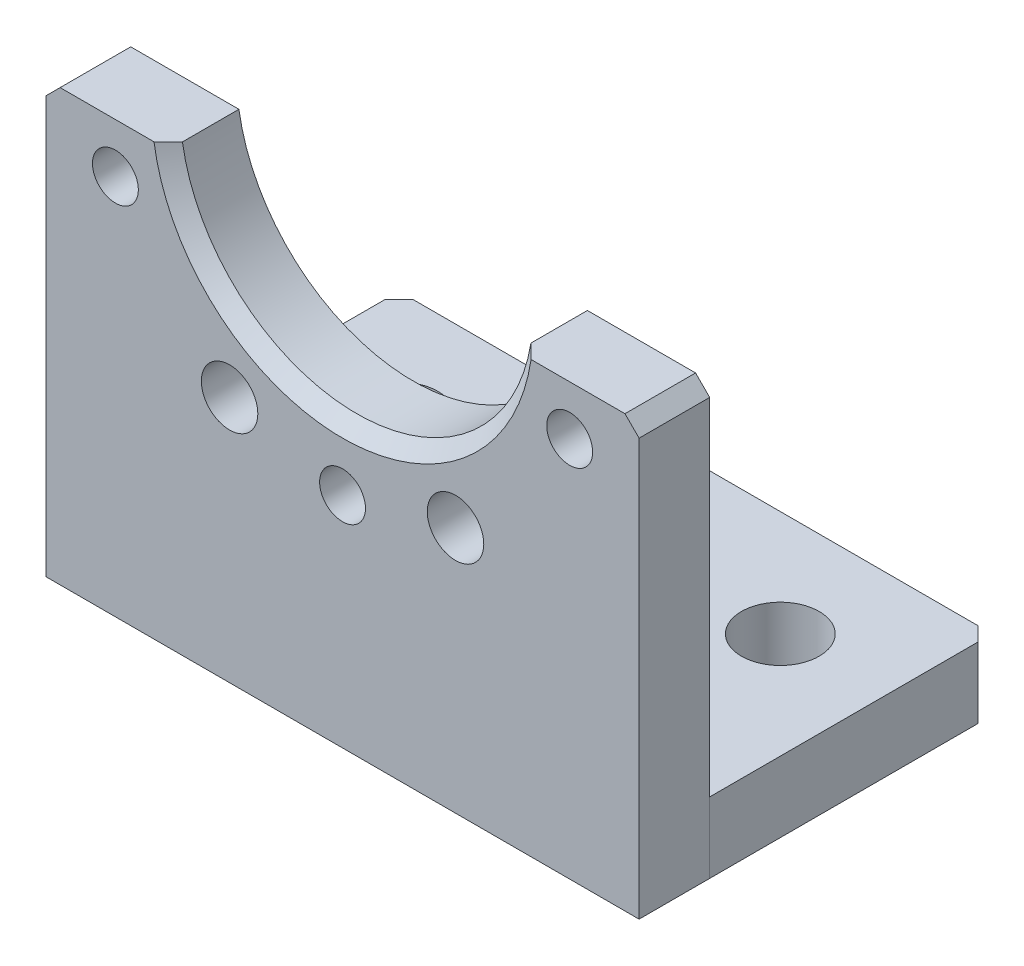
ISO-10303-21;
HEADER;
FILE_DESCRIPTION(('STEP AP214'),'2;1');
FILE_NAME('part.step','',(''),(''),'','','');
FILE_SCHEMA(('AUTOMOTIVE_DESIGN { 1 0 10303 214 1 1 1 1 }'));
ENDSEC;
DATA;
#1=APPLICATION_CONTEXT('core data for automotive mechanical design processes');
#2=APPLICATION_PROTOCOL_DEFINITION('international standard','automotive_design',2000,#1);
#3=PRODUCT_CONTEXT('',#1,'mechanical');
#4=PRODUCT('Part','Part','',(#3));
#5=PRODUCT_RELATED_PRODUCT_CATEGORY('part','',(#4));
#6=PRODUCT_DEFINITION_FORMATION('','',#4);
#7=PRODUCT_DEFINITION_CONTEXT('part definition',#1,'design');
#8=PRODUCT_DEFINITION('design','',#6,#7);
#9=PRODUCT_DEFINITION_SHAPE('','',#8);
#10=(LENGTH_UNIT() NAMED_UNIT(*) SI_UNIT(.MILLI.,.METRE.));
#11=(NAMED_UNIT(*) PLANE_ANGLE_UNIT() SI_UNIT($,.RADIAN.));
#12=(NAMED_UNIT(*) SI_UNIT($,.STERADIAN.) SOLID_ANGLE_UNIT());
#13=UNCERTAINTY_MEASURE_WITH_UNIT(LENGTH_MEASURE(1.E-05),#10,'distance_accuracy_value','');
#14=(GEOMETRIC_REPRESENTATION_CONTEXT(3) GLOBAL_UNCERTAINTY_ASSIGNED_CONTEXT((#13)) GLOBAL_UNIT_ASSIGNED_CONTEXT((#10,
#11,#12)) REPRESENTATION_CONTEXT('',''));
#15=CARTESIAN_POINT('',(0.,0.,0.));
#16=DIRECTION('',(0.,0.,1.));
#17=DIRECTION('',(1.,0.,0.));
#18=AXIS2_PLACEMENT_3D('',#15,#16,#17);
#19=CARTESIAN_POINT('',(-42.,59.,-10.));
#20=DIRECTION('',(0.,0.,-1.));
#21=DIRECTION('',(-1.,0.,0.));
#22=AXIS2_PLACEMENT_3D('',#19,#20,#21);
#23=PLANE('',#22);
#24=DIRECTION('',(1.,0.,0.));
#25=VECTOR('',#24,1.);
#26=CARTESIAN_POINT('',(-42.,0.,-10.));
#27=LINE('',#26,#25);
#28=CARTESIAN_POINT('',(-42.,0.,-10.));
#29=VERTEX_POINT('',#28);
#30=CARTESIAN_POINT('',(42.,0.,-10.));
#31=VERTEX_POINT('',#30);
#32=EDGE_CURVE('E138',#29,#31,#27,.T.);
#33=ORIENTED_EDGE('',*,*,#32,.F.);
#34=DIRECTION('',(0.,-1.,0.));
#35=VECTOR('',#34,1.);
#36=CARTESIAN_POINT('',(-42.,0.,-10.));
#37=LINE('',#36,#35);
#38=CARTESIAN_POINT('',(-42.,59.,-10.));
#39=VERTEX_POINT('',#38);
#40=EDGE_CURVE('E146',#39,#29,#37,.T.);
#41=ORIENTED_EDGE('',*,*,#40,.F.);
#42=DIRECTION('',(-0.707106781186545,-0.70710678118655,0.));
#43=VECTOR('',#42,1.);
#44=CARTESIAN_POINT('',(-50.5000000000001,50.4999999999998,-10.));
#45=LINE('',#44,#43);
#46=CARTESIAN_POINT('',(-40.,61.,-10.));
#47=VERTEX_POINT('',#46);
#48=EDGE_CURVE('E240',#39,#47,#45,.F.);
#49=ORIENTED_EDGE('',*,*,#48,.T.);
#50=DIRECTION('',(-1.,0.,0.));
#51=VECTOR('',#50,1.);
#52=CARTESIAN_POINT('',(-42.,61.,-10.));
#53=LINE('',#52,#51);
#54=CARTESIAN_POINT('',(-24.6779253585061,61.,-10.));
#55=VERTEX_POINT('',#54);
#56=EDGE_CURVE('E147',#55,#47,#53,.T.);
#57=ORIENTED_EDGE('',*,*,#56,.F.);
#58=CARTESIAN_POINT('',(0.,65.,-10.));
#59=DIRECTION('',(0.,0.,-1.));
#60=DIRECTION('',(-1.,0.,0.));
#61=AXIS2_PLACEMENT_3D('',#58,#59,#60);
#62=CIRCLE('',#61,25.);
#63=CARTESIAN_POINT('',(24.6779253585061,61.,-10.));
#64=VERTEX_POINT('',#63);
#65=EDGE_CURVE('E76',#64,#55,#62,.T.);
#66=ORIENTED_EDGE('',*,*,#65,.F.);
#67=CARTESIAN_POINT('',(40.,61.,-10.));
#68=VERTEX_POINT('',#67);
#69=EDGE_CURVE('E184',#68,#64,#53,.T.);
#70=ORIENTED_EDGE('',*,*,#69,.F.);
#71=DIRECTION('',(-0.707106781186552,0.707106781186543,0.));
#72=VECTOR('',#71,1.);
#73=CARTESIAN_POINT('',(50.4999999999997,50.5000000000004,-10.));
#74=LINE('',#73,#72);
#75=CARTESIAN_POINT('',(42.,59.,-10.));
#76=VERTEX_POINT('',#75);
#77=EDGE_CURVE('E141',#68,#76,#74,.F.);
#78=ORIENTED_EDGE('',*,*,#77,.T.);
#79=DIRECTION('',(0.,1.,0.));
#80=VECTOR('',#79,1.);
#81=CARTESIAN_POINT('',(42.,0.,-10.));
#82=LINE('',#81,#80);
#83=EDGE_CURVE('E134',#31,#76,#82,.T.);
#84=ORIENTED_EDGE('',*,*,#83,.F.);
#85=EDGE_LOOP('',(#33,#41,#49,#57,#66,#70,#78,#84));
#86=FACE_BOUND('',#85,.T.);
#87=CARTESIAN_POINT('',(16.,35.,-10.));
#88=DIRECTION('',(0.,0.,-1.));
#89=DIRECTION('',(-1.,0.,0.));
#90=AXIS2_PLACEMENT_3D('',#87,#88,#89);
#91=CIRCLE('',#90,4.);
#92=CARTESIAN_POINT('',(12.,35.,-10.));
#93=VERTEX_POINT('',#92);
#94=EDGE_CURVE('E68',#93,#93,#91,.T.);
#95=ORIENTED_EDGE('',*,*,#94,.F.);
#96=EDGE_LOOP('',(#95));
#97=FACE_BOUND('',#96,.T.);
#98=CARTESIAN_POINT('',(-16.,35.,-10.));
#99=DIRECTION('',(0.,0.,-1.));
#100=DIRECTION('',(-1.,0.,0.));
#101=AXIS2_PLACEMENT_3D('',#98,#99,#100);
#102=CIRCLE('',#101,4.);
#103=CARTESIAN_POINT('',(-20.,35.,-10.));
#104=VERTEX_POINT('',#103);
#105=EDGE_CURVE('E166',#104,#104,#102,.T.);
#106=ORIENTED_EDGE('',*,*,#105,.F.);
#107=EDGE_LOOP('',(#106));
#108=FACE_BOUND('',#107,.T.);
#109=CARTESIAN_POINT('',(-32.1714158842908,54.,-10.));
#110=DIRECTION('',(0.,0.,-1.));
#111=DIRECTION('',(-1.,0.,0.));
#112=AXIS2_PLACEMENT_3D('',#109,#110,#111);
#113=CIRCLE('',#112,3.25);
#114=CARTESIAN_POINT('',(-35.4214158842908,54.,-10.));
#115=VERTEX_POINT('',#114);
#116=EDGE_CURVE('E170',#115,#115,#113,.T.);
#117=ORIENTED_EDGE('',*,*,#116,.F.);
#118=EDGE_LOOP('',(#117));
#119=FACE_BOUND('',#118,.T.);
#120=CARTESIAN_POINT('',(32.1714158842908,54.,-10.));
#121=DIRECTION('',(0.,0.,-1.));
#122=DIRECTION('',(-1.,0.,0.));
#123=AXIS2_PLACEMENT_3D('',#120,#121,#122);
#124=CIRCLE('',#123,3.25);
#125=CARTESIAN_POINT('',(28.9214158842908,54.,-10.));
#126=VERTEX_POINT('',#125);
#127=EDGE_CURVE('E174',#126,#126,#124,.T.);
#128=ORIENTED_EDGE('',*,*,#127,.F.);
#129=EDGE_LOOP('',(#128));
#130=FACE_BOUND('',#129,.T.);
#131=CARTESIAN_POINT('',(0.,31.,-10.));
#132=DIRECTION('',(0.,0.,-1.));
#133=DIRECTION('',(-1.,0.,0.));
#134=AXIS2_PLACEMENT_3D('',#131,#132,#133);
#135=CIRCLE('',#134,3.25);
#136=CARTESIAN_POINT('',(-3.25,31.,-10.));
#137=VERTEX_POINT('',#136);
#138=EDGE_CURVE('E178',#137,#137,#135,.T.);
#139=ORIENTED_EDGE('',*,*,#138,.F.);
#140=EDGE_LOOP('',(#139));
#141=FACE_BOUND('',#140,.T.);
#142=ADVANCED_FACE('F59',(#86,#97,#108,#119,#130,#141),#23,.T.);
#143=CARTESIAN_POINT('',(-42.,0.,-50.));
#144=DIRECTION('',(0.,-1.,0.));
#145=DIRECTION('',(0.,0.,-1.));
#146=AXIS2_PLACEMENT_3D('',#143,#144,#145);
#147=PLANE('',#146);
#148=DIRECTION('',(0.,0.,1.));
#149=VECTOR('',#148,1.);
#150=CARTESIAN_POINT('',(-42.,0.,-50.));
#151=LINE('',#150,#149);
#152=CARTESIAN_POINT('',(-42.,0.,0.));
#153=VERTEX_POINT('',#152);
#154=EDGE_CURVE('E63',#29,#153,#151,.T.);
#155=ORIENTED_EDGE('',*,*,#154,.F.);
#156=ORIENTED_EDGE('',*,*,#32,.T.);
#157=DIRECTION('',(0.,0.,1.));
#158=VECTOR('',#157,1.);
#159=CARTESIAN_POINT('',(42.,0.,-50.));
#160=LINE('',#159,#158);
#161=CARTESIAN_POINT('',(42.,0.,0.));
#162=VERTEX_POINT('',#161);
#163=EDGE_CURVE('E151',#31,#162,#160,.T.);
#164=ORIENTED_EDGE('',*,*,#163,.T.);
#165=DIRECTION('',(1.,0.,0.));
#166=VECTOR('',#165,1.);
#167=CARTESIAN_POINT('',(-42.,0.,0.));
#168=LINE('',#167,#166);
#169=EDGE_CURVE('E188',#153,#162,#168,.T.);
#170=ORIENTED_EDGE('',*,*,#169,.F.);
#171=EDGE_LOOP('',(#155,#156,#164,#170));
#172=FACE_BOUND('',#171,.T.);
#173=ADVANCED_FACE('F61',(#172),#147,.T.);
#174=CARTESIAN_POINT('',(0.,65.,-2.));
#175=DIRECTION('',(0.,0.,1.));
#176=DIRECTION('',(1.,0.,0.));
#177=AXIS2_PLACEMENT_3D('',#174,#175,#176);
#178=CONICAL_SURFACE('',#177,25.,0.785398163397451);
#179=CARTESIAN_POINT('',(-26.7020598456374,61.,0.));
#180=CARTESIAN_POINT('',(-26.3648597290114,61.,-0.333490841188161));
#181=CARTESIAN_POINT('',(-26.0275817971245,61.,-0.666902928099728));
#182=CARTESIAN_POINT('',(-25.3528703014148,61.,-1.33356959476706));
#183=CARTESIAN_POINT('',(-25.0154367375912,61.,-1.66682417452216));
#184=CARTESIAN_POINT('',(-24.6779253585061,61.,-2.));
#185=B_SPLINE_CURVE_WITH_KNOTS('',3,(#179,#180,#181,#182,#183,#184),.UNSPECIFIED.,.F.,.F.,(4,2,
4),(0.,1.42277201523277,2.84554403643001),.UNSPECIFIED.);
#186=CARTESIAN_POINT('',(-26.7020598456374,61.,0.));
#187=VERTEX_POINT('',#186);
#188=CARTESIAN_POINT('',(-24.6779253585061,61.,-2.00000000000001));
#189=VERTEX_POINT('',#188);
#190=EDGE_CURVE('E223',#187,#189,#185,.T.);
#191=ORIENTED_EDGE('',*,*,#190,.F.);
#192=CARTESIAN_POINT('',(0.,65.,0.));
#193=DIRECTION('',(0.,0.,-1.));
#194=DIRECTION('',(-1.,0.,0.));
#195=AXIS2_PLACEMENT_3D('',#192,#193,#194);
#196=CIRCLE('',#195,27.);
#197=CARTESIAN_POINT('',(26.7020598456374,61.,0.));
#198=VERTEX_POINT('',#197);
#199=EDGE_CURVE('E209',#198,#187,#196,.T.);
#200=ORIENTED_EDGE('',*,*,#199,.F.);
#201=CARTESIAN_POINT('',(24.6779253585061,61.,-2.));
#202=CARTESIAN_POINT('',(25.0154367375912,61.,-1.66682417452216));
#203=CARTESIAN_POINT('',(25.3528703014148,61.,-1.33356959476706));
#204=CARTESIAN_POINT('',(26.0275817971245,61.,-0.666902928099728));
#205=CARTESIAN_POINT('',(26.3648597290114,61.,-0.333490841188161));
#206=CARTESIAN_POINT('',(26.7020598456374,61.,0.));
#207=B_SPLINE_CURVE_WITH_KNOTS('',3,(#201,#202,#203,#204,#205,#206),.UNSPECIFIED.,.F.,.F.,(4,2,
4),(0.,1.42277202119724,2.84554403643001),.UNSPECIFIED.);
#208=CARTESIAN_POINT('',(24.6779253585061,61.,-2.00000000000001));
#209=VERTEX_POINT('',#208);
#210=EDGE_CURVE('E201',#209,#198,#207,.T.);
#211=ORIENTED_EDGE('',*,*,#210,.F.);
#212=CARTESIAN_POINT('',(0.,65.,-2.));
#213=DIRECTION('',(0.,0.,-1.));
#214=DIRECTION('',(-1.,0.,0.));
#215=AXIS2_PLACEMENT_3D('',#212,#213,#214);
#216=CIRCLE('',#215,25.);
#217=EDGE_CURVE('E160',#189,#209,#216,.F.);
#218=ORIENTED_EDGE('',*,*,#217,.F.);
#219=EDGE_LOOP('',(#191,#200,#211,#218));
#220=FACE_BOUND('',#219,.T.);
#221=ADVANCED_FACE('F214',(#220),#178,.F.);
#222=CARTESIAN_POINT('',(-42.,61.,-50.));
#223=DIRECTION('',(0.,1.,0.));
#224=DIRECTION('',(0.,0.,1.));
#225=AXIS2_PLACEMENT_3D('',#222,#223,#224);
#226=PLANE('',#225);
#227=ORIENTED_EDGE('',*,*,#56,.T.);
#228=DIRECTION('',(0.,0.,1.));
#229=VECTOR('',#228,1.);
#230=CARTESIAN_POINT('',(-40.,61.,-50.));
#231=LINE('',#230,#229);
#232=CARTESIAN_POINT('',(-40.,61.,0.));
#233=VERTEX_POINT('',#232);
#234=EDGE_CURVE('E232',#47,#233,#231,.T.);
#235=ORIENTED_EDGE('',*,*,#234,.T.);
#236=DIRECTION('',(-1.,0.,0.));
#237=VECTOR('',#236,1.);
#238=CARTESIAN_POINT('',(-42.,61.,0.));
#239=LINE('',#238,#237);
#240=EDGE_CURVE('E191',#187,#233,#239,.T.);
#241=ORIENTED_EDGE('',*,*,#240,.F.);
#242=ORIENTED_EDGE('',*,*,#190,.T.);
#243=DIRECTION('',(0.,0.,1.));
#244=VECTOR('',#243,1.);
#245=CARTESIAN_POINT('',(-24.6779253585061,61.,-50.));
#246=LINE('',#245,#244);
#247=EDGE_CURVE('E181',#55,#189,#246,.T.);
#248=ORIENTED_EDGE('',*,*,#247,.F.);
#249=EDGE_LOOP('',(#227,#235,#241,#242,#248));
#250=FACE_BOUND('',#249,.T.);
#251=ADVANCED_FACE('F218',(#250),#226,.T.);
#252=CARTESIAN_POINT('',(42.,0.,-50.));
#253=DIRECTION('',(1.,0.,0.));
#254=DIRECTION('',(0.,1.,0.));
#255=AXIS2_PLACEMENT_3D('',#252,#253,#254);
#256=PLANE('',#255);
#257=ORIENTED_EDGE('',*,*,#163,.F.);
#258=ORIENTED_EDGE('',*,*,#83,.T.);
#259=DIRECTION('',(0.,0.,1.));
#260=VECTOR('',#259,1.);
#261=CARTESIAN_POINT('',(42.,59.,-50.));
#262=LINE('',#261,#260);
#263=CARTESIAN_POINT('',(42.,59.,0.));
#264=VERTEX_POINT('',#263);
#265=EDGE_CURVE('E230',#76,#264,#262,.T.);
#266=ORIENTED_EDGE('',*,*,#265,.T.);
#267=DIRECTION('',(0.,1.,0.));
#268=VECTOR('',#267,1.);
#269=CARTESIAN_POINT('',(42.,0.,0.));
#270=LINE('',#269,#268);
#271=EDGE_CURVE('E157',#162,#264,#270,.T.);
#272=ORIENTED_EDGE('',*,*,#271,.F.);
#273=EDGE_LOOP('',(#257,#258,#266,#272));
#274=FACE_BOUND('',#273,.T.);
#275=ADVANCED_FACE('F155',(#274),#256,.T.);
#276=CARTESIAN_POINT('',(0.,0.,0.));
#277=DIRECTION('',(0.,0.,-1.));
#278=DIRECTION('',(-1.,0.,0.));
#279=AXIS2_PLACEMENT_3D('',#276,#277,#278);
#280=PLANE('',#279);
#281=CARTESIAN_POINT('',(16.,35.,0.));
#282=DIRECTION('',(0.,0.,1.));
#283=DIRECTION('',(1.,0.,0.));
#284=AXIS2_PLACEMENT_3D('',#281,#282,#283);
#285=CIRCLE('',#284,4.);
#286=CARTESIAN_POINT('',(20.,35.,0.));
#287=VERTEX_POINT('',#286);
#288=EDGE_CURVE('E15',#287,#287,#285,.T.);
#289=ORIENTED_EDGE('',*,*,#288,.F.);
#290=EDGE_LOOP('',(#289));
#291=FACE_BOUND('',#290,.T.);
#292=CARTESIAN_POINT('',(-16.,35.,0.));
#293=DIRECTION('',(0.,0.,1.));
#294=DIRECTION('',(1.,0.,0.));
#295=AXIS2_PLACEMENT_3D('',#292,#293,#294);
#296=CIRCLE('',#295,4.);
#297=CARTESIAN_POINT('',(-12.,35.,0.));
#298=VERTEX_POINT('',#297);
#299=EDGE_CURVE('E163',#298,#298,#296,.T.);
#300=ORIENTED_EDGE('',*,*,#299,.F.);
#301=EDGE_LOOP('',(#300));
#302=FACE_BOUND('',#301,.T.);
#303=CARTESIAN_POINT('',(-32.1714158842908,54.,0.));
#304=DIRECTION('',(0.,0.,1.));
#305=DIRECTION('',(1.,0.,0.));
#306=AXIS2_PLACEMENT_3D('',#303,#304,#305);
#307=CIRCLE('',#306,3.25);
#308=CARTESIAN_POINT('',(-28.9214158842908,54.,0.));
#309=VERTEX_POINT('',#308);
#310=EDGE_CURVE('E167',#309,#309,#307,.T.);
#311=ORIENTED_EDGE('',*,*,#310,.F.);
#312=EDGE_LOOP('',(#311));
#313=FACE_BOUND('',#312,.T.);
#314=CARTESIAN_POINT('',(32.1714158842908,54.,0.));
#315=DIRECTION('',(0.,0.,1.));
#316=DIRECTION('',(1.,0.,0.));
#317=AXIS2_PLACEMENT_3D('',#314,#315,#316);
#318=CIRCLE('',#317,3.25);
#319=CARTESIAN_POINT('',(35.4214158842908,54.,0.));
#320=VERTEX_POINT('',#319);
#321=EDGE_CURVE('E171',#320,#320,#318,.T.);
#322=ORIENTED_EDGE('',*,*,#321,.F.);
#323=EDGE_LOOP('',(#322));
#324=FACE_BOUND('',#323,.T.);
#325=CARTESIAN_POINT('',(0.,31.,0.));
#326=DIRECTION('',(0.,0.,1.));
#327=DIRECTION('',(1.,0.,0.));
#328=AXIS2_PLACEMENT_3D('',#325,#326,#327);
#329=CIRCLE('',#328,3.25);
#330=CARTESIAN_POINT('',(3.25,31.,0.));
#331=VERTEX_POINT('',#330);
#332=EDGE_CURVE('E175',#331,#331,#329,.T.);
#333=ORIENTED_EDGE('',*,*,#332,.F.);
#334=EDGE_LOOP('',(#333));
#335=FACE_BOUND('',#334,.T.);
#336=ORIENTED_EDGE('',*,*,#240,.T.);
#337=DIRECTION('',(0.707106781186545,0.70710678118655,0.));
#338=VECTOR('',#337,1.);
#339=CARTESIAN_POINT('',(-40.,61.,0.));
#340=LINE('',#339,#338);
#341=CARTESIAN_POINT('',(-42.,59.,0.));
#342=VERTEX_POINT('',#341);
#343=EDGE_CURVE('E237',#233,#342,#340,.F.);
#344=ORIENTED_EDGE('',*,*,#343,.T.);
#345=DIRECTION('',(0.,-1.,0.));
#346=VECTOR('',#345,1.);
#347=CARTESIAN_POINT('',(-42.,0.,0.));
#348=LINE('',#347,#346);
#349=EDGE_CURVE('E185',#342,#153,#348,.T.);
#350=ORIENTED_EDGE('',*,*,#349,.T.);
#351=ORIENTED_EDGE('',*,*,#169,.T.);
#352=ORIENTED_EDGE('',*,*,#271,.T.);
#353=DIRECTION('',(0.707106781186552,-0.707106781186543,0.));
#354=VECTOR('',#353,1.);
#355=CARTESIAN_POINT('',(42.,59.,0.));
#356=LINE('',#355,#354);
#357=CARTESIAN_POINT('',(40.,61.,0.));
#358=VERTEX_POINT('',#357);
#359=EDGE_CURVE('E235',#264,#358,#356,.F.);
#360=ORIENTED_EDGE('',*,*,#359,.T.);
#361=EDGE_CURVE('E159',#358,#198,#239,.T.);
#362=ORIENTED_EDGE('',*,*,#361,.T.);
#363=ORIENTED_EDGE('',*,*,#199,.T.);
#364=EDGE_LOOP('',(#336,#344,#350,#351,#352,#360,#362,#363));
#365=FACE_BOUND('',#364,.T.);
#366=ADVANCED_FACE('F269',(#291,#302,#313,#324,#335,#365),#280,.F.);
#367=CARTESIAN_POINT('',(16.,35.,-50.));
#368=DIRECTION('',(0.,0.,1.));
#369=DIRECTION('',(1.,0.,0.));
#370=AXIS2_PLACEMENT_3D('',#367,#368,#369);
#371=CYLINDRICAL_SURFACE('',#370,4.);
#372=ORIENTED_EDGE('',*,*,#94,.T.);
#373=EDGE_LOOP('',(#372));
#374=FACE_BOUND('',#373,.T.);
#375=ORIENTED_EDGE('',*,*,#288,.T.);
#376=EDGE_LOOP('',(#375));
#377=FACE_BOUND('',#376,.T.);
#378=ADVANCED_FACE('F248',(#374,#377),#371,.F.);
#379=CARTESIAN_POINT('',(-16.,35.,-50.));
#380=DIRECTION('',(0.,0.,1.));
#381=DIRECTION('',(1.,0.,0.));
#382=AXIS2_PLACEMENT_3D('',#379,#380,#381);
#383=CYLINDRICAL_SURFACE('',#382,4.);
#384=ORIENTED_EDGE('',*,*,#105,.T.);
#385=EDGE_LOOP('',(#384));
#386=FACE_BOUND('',#385,.T.);
#387=ORIENTED_EDGE('',*,*,#299,.T.);
#388=EDGE_LOOP('',(#387));
#389=FACE_BOUND('',#388,.T.);
#390=ADVANCED_FACE('F330',(#386,#389),#383,.F.);
#391=ORIENTED_EDGE('',*,*,#361,.F.);
#392=DIRECTION('',(0.,0.,-1.));
#393=VECTOR('',#392,1.);
#394=CARTESIAN_POINT('',(40.,61.,-50.));
#395=LINE('',#394,#393);
#396=EDGE_CURVE('E153',#358,#68,#395,.T.);
#397=ORIENTED_EDGE('',*,*,#396,.T.);
#398=ORIENTED_EDGE('',*,*,#69,.T.);
#399=DIRECTION('',(0.,0.,1.));
#400=VECTOR('',#399,1.);
#401=CARTESIAN_POINT('',(24.6779253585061,61.,-50.));
#402=LINE('',#401,#400);
#403=EDGE_CURVE('E179',#209,#64,#402,.F.);
#404=ORIENTED_EDGE('',*,*,#403,.F.);
#405=ORIENTED_EDGE('',*,*,#210,.T.);
#406=EDGE_LOOP('',(#391,#397,#398,#404,#405));
#407=FACE_BOUND('',#406,.T.);
#408=ADVANCED_FACE('F211',(#407),#226,.T.);
#409=CARTESIAN_POINT('',(42.,59.,-50.));
#410=DIRECTION('',(-0.707106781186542,-0.707106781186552,0.));
#411=DIRECTION('',(0.,0.,1.));
#412=AXIS2_PLACEMENT_3D('',#409,#410,#411);
#413=PLANE('',#412);
#414=ORIENTED_EDGE('',*,*,#77,.F.);
#415=ORIENTED_EDGE('',*,*,#396,.F.);
#416=ORIENTED_EDGE('',*,*,#359,.F.);
#417=ORIENTED_EDGE('',*,*,#265,.F.);
#418=EDGE_LOOP('',(#414,#415,#416,#417));
#419=FACE_BOUND('',#418,.T.);
#420=ADVANCED_FACE('F287',(#419),#413,.F.);
#421=CARTESIAN_POINT('',(-42.,0.,-50.));
#422=DIRECTION('',(-1.,0.,0.));
#423=DIRECTION('',(0.,0.,1.));
#424=AXIS2_PLACEMENT_3D('',#421,#422,#423);
#425=PLANE('',#424);
#426=ORIENTED_EDGE('',*,*,#40,.T.);
#427=ORIENTED_EDGE('',*,*,#154,.T.);
#428=ORIENTED_EDGE('',*,*,#349,.F.);
#429=DIRECTION('',(0.,0.,-1.));
#430=VECTOR('',#429,1.);
#431=CARTESIAN_POINT('',(-42.,59.,-50.));
#432=LINE('',#431,#430);
#433=EDGE_CURVE('E228',#342,#39,#432,.T.);
#434=ORIENTED_EDGE('',*,*,#433,.T.);
#435=EDGE_LOOP('',(#426,#427,#428,#434));
#436=FACE_BOUND('',#435,.T.);
#437=ADVANCED_FACE('F289',(#436),#425,.T.);
#438=CARTESIAN_POINT('',(-40.,61.,-50.));
#439=DIRECTION('',(0.70710678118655,-0.707106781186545,0.));
#440=DIRECTION('',(0.,0.,1.));
#441=AXIS2_PLACEMENT_3D('',#438,#439,#440);
#442=PLANE('',#441);
#443=ORIENTED_EDGE('',*,*,#48,.F.);
#444=ORIENTED_EDGE('',*,*,#433,.F.);
#445=ORIENTED_EDGE('',*,*,#343,.F.);
#446=ORIENTED_EDGE('',*,*,#234,.F.);
#447=EDGE_LOOP('',(#443,#444,#445,#446));
#448=FACE_BOUND('',#447,.T.);
#449=ADVANCED_FACE('F220',(#448),#442,.F.);
#450=CARTESIAN_POINT('',(-32.1714158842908,54.,-50.));
#451=DIRECTION('',(0.,0.,1.));
#452=DIRECTION('',(1.,0.,0.));
#453=AXIS2_PLACEMENT_3D('',#450,#451,#452);
#454=CYLINDRICAL_SURFACE('',#453,3.25);
#455=ORIENTED_EDGE('',*,*,#116,.T.);
#456=EDGE_LOOP('',(#455));
#457=FACE_BOUND('',#456,.T.);
#458=ORIENTED_EDGE('',*,*,#310,.T.);
#459=EDGE_LOOP('',(#458));
#460=FACE_BOUND('',#459,.T.);
#461=ADVANCED_FACE('F293',(#457,#460),#454,.F.);
#462=CARTESIAN_POINT('',(32.1714158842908,54.,-50.));
#463=DIRECTION('',(0.,0.,1.));
#464=DIRECTION('',(1.,0.,0.));
#465=AXIS2_PLACEMENT_3D('',#462,#463,#464);
#466=CYLINDRICAL_SURFACE('',#465,3.25);
#467=ORIENTED_EDGE('',*,*,#127,.T.);
#468=EDGE_LOOP('',(#467));
#469=FACE_BOUND('',#468,.T.);
#470=ORIENTED_EDGE('',*,*,#321,.T.);
#471=EDGE_LOOP('',(#470));
#472=FACE_BOUND('',#471,.T.);
#473=ADVANCED_FACE('F265',(#469,#472),#466,.F.);
#474=CARTESIAN_POINT('',(0.,31.,-50.));
#475=DIRECTION('',(0.,0.,1.));
#476=DIRECTION('',(1.,0.,0.));
#477=AXIS2_PLACEMENT_3D('',#474,#475,#476);
#478=CYLINDRICAL_SURFACE('',#477,3.25);
#479=ORIENTED_EDGE('',*,*,#138,.T.);
#480=EDGE_LOOP('',(#479));
#481=FACE_BOUND('',#480,.T.);
#482=ORIENTED_EDGE('',*,*,#332,.T.);
#483=EDGE_LOOP('',(#482));
#484=FACE_BOUND('',#483,.T.);
#485=ADVANCED_FACE('F262',(#481,#484),#478,.F.);
#486=CARTESIAN_POINT('',(0.,65.,-50.));
#487=DIRECTION('',(0.,0.,1.));
#488=DIRECTION('',(1.,0.,0.));
#489=AXIS2_PLACEMENT_3D('',#486,#487,#488);
#490=CYLINDRICAL_SURFACE('',#489,25.);
#491=ORIENTED_EDGE('',*,*,#247,.T.);
#492=ORIENTED_EDGE('',*,*,#217,.T.);
#493=ORIENTED_EDGE('',*,*,#403,.T.);
#494=ORIENTED_EDGE('',*,*,#65,.T.);
#495=EDGE_LOOP('',(#491,#492,#493,#494));
#496=FACE_BOUND('',#495,.T.);
#497=ADVANCED_FACE('F253',(#496),#490,.F.);
#498=CLOSED_SHELL('',(#142,#173,#221,#251,#275,#366,#378,#390,#408,#420,#437,#449,#461,#473,
#485,#497));
#499=MANIFOLD_SOLID_BREP('B2',#498);
#500=CARTESIAN_POINT('',(-42.,59.,-10.));
#501=DIRECTION('',(0.,0.,-1.));
#502=DIRECTION('',(-1.,0.,0.));
#503=AXIS2_PLACEMENT_3D('',#500,#501,#502);
#504=PLANE('',#503);
#505=DIRECTION('',(1.,0.,0.));
#506=VECTOR('',#505,1.);
#507=CARTESIAN_POINT('',(-42.,0.,-10.));
#508=LINE('',#507,#506);
#509=CARTESIAN_POINT('',(-42.,0.,-10.));
#510=VERTEX_POINT('',#509);
#511=CARTESIAN_POINT('',(42.,0.,-10.));
#512=VERTEX_POINT('',#511);
#513=EDGE_CURVE('E57',#510,#512,#508,.T.);
#514=ORIENTED_EDGE('',*,*,#513,.T.);
#515=DIRECTION('',(0.,1.,0.));
#516=VECTOR('',#515,1.);
#517=CARTESIAN_POINT('',(42.,0.,-10.));
#518=LINE('',#517,#516);
#519=CARTESIAN_POINT('',(42.,10.,-10.));
#520=VERTEX_POINT('',#519);
#521=EDGE_CURVE('E440',#512,#520,#518,.T.);
#522=ORIENTED_EDGE('',*,*,#521,.T.);
#523=DIRECTION('',(1.,0.,0.));
#524=VECTOR('',#523,1.);
#525=CARTESIAN_POINT('',(-42.,10.,-10.));
#526=LINE('',#525,#524);
#527=CARTESIAN_POINT('',(-42.,10.,-10.));
#528=VERTEX_POINT('',#527);
#529=EDGE_CURVE('E493',#528,#520,#526,.T.);
#530=ORIENTED_EDGE('',*,*,#529,.F.);
#531=DIRECTION('',(0.,-1.,0.));
#532=VECTOR('',#531,1.);
#533=CARTESIAN_POINT('',(-42.,0.,-10.));
#534=LINE('',#533,#532);
#535=EDGE_CURVE('E446',#528,#510,#534,.T.);
#536=ORIENTED_EDGE('',*,*,#535,.T.);
#537=EDGE_LOOP('',(#514,#522,#530,#536));
#538=FACE_BOUND('',#537,.T.);
#539=ADVANCED_FACE('F433',(#538),#504,.F.);
#540=CARTESIAN_POINT('',(-42.,0.,-50.));
#541=DIRECTION('',(-1.,0.,0.));
#542=DIRECTION('',(0.,0.,1.));
#543=AXIS2_PLACEMENT_3D('',#540,#541,#542);
#544=PLANE('',#543);
#545=ORIENTED_EDGE('',*,*,#535,.F.);
#546=DIRECTION('',(0.,0.,1.));
#547=VECTOR('',#546,1.);
#548=CARTESIAN_POINT('',(-42.,10.,-50.));
#549=LINE('',#548,#547);
#550=CARTESIAN_POINT('',(-42.,10.,-48.));
#551=VERTEX_POINT('',#550);
#552=EDGE_CURVE('E488',#551,#528,#549,.T.);
#553=ORIENTED_EDGE('',*,*,#552,.F.);
#554=DIRECTION('',(0.,-1.,0.));
#555=VECTOR('',#554,1.);
#556=CARTESIAN_POINT('',(-42.,0.,-48.));
#557=LINE('',#556,#555);
#558=CARTESIAN_POINT('',(-42.,0.,-48.));
#559=VERTEX_POINT('',#558);
#560=EDGE_CURVE('E516',#551,#559,#557,.T.);
#561=ORIENTED_EDGE('',*,*,#560,.T.);
#562=DIRECTION('',(0.,0.,1.));
#563=VECTOR('',#562,1.);
#564=CARTESIAN_POINT('',(-42.,0.,-50.));
#565=LINE('',#564,#563);
#566=EDGE_CURVE('E491',#559,#510,#565,.T.);
#567=ORIENTED_EDGE('',*,*,#566,.T.);
#568=EDGE_LOOP('',(#545,#553,#561,#567));
#569=FACE_BOUND('',#568,.T.);
#570=ADVANCED_FACE('F485',(#569),#544,.T.);
#571=CARTESIAN_POINT('',(42.,0.,-50.));
#572=DIRECTION('',(1.,0.,0.));
#573=DIRECTION('',(0.,1.,0.));
#574=AXIS2_PLACEMENT_3D('',#571,#572,#573);
#575=PLANE('',#574);
#576=ORIENTED_EDGE('',*,*,#521,.F.);
#577=DIRECTION('',(0.,0.,1.));
#578=VECTOR('',#577,1.);
#579=CARTESIAN_POINT('',(42.,0.,-50.));
#580=LINE('',#579,#578);
#581=CARTESIAN_POINT('',(42.,0.,-48.));
#582=VERTEX_POINT('',#581);
#583=EDGE_CURVE('E513',#582,#512,#580,.T.);
#584=ORIENTED_EDGE('',*,*,#583,.F.);
#585=DIRECTION('',(0.,1.,0.));
#586=VECTOR('',#585,1.);
#587=CARTESIAN_POINT('',(42.,0.,-48.));
#588=LINE('',#587,#586);
#589=CARTESIAN_POINT('',(42.,10.,-48.));
#590=VERTEX_POINT('',#589);
#591=EDGE_CURVE('E492',#582,#590,#588,.T.);
#592=ORIENTED_EDGE('',*,*,#591,.T.);
#593=DIRECTION('',(0.,0.,1.));
#594=VECTOR('',#593,1.);
#595=CARTESIAN_POINT('',(42.,10.,-50.));
#596=LINE('',#595,#594);
#597=EDGE_CURVE('E503',#590,#520,#596,.T.);
#598=ORIENTED_EDGE('',*,*,#597,.T.);
#599=EDGE_LOOP('',(#576,#584,#592,#598));
#600=FACE_BOUND('',#599,.T.);
#601=ADVANCED_FACE('F533',(#600),#575,.T.);
#602=CARTESIAN_POINT('',(0.,0.,-50.));
#603=DIRECTION('',(0.,0.,-1.));
#604=DIRECTION('',(-1.,0.,0.));
#605=AXIS2_PLACEMENT_3D('',#602,#603,#604);
#606=PLANE('',#605);
#607=DIRECTION('',(1.,0.,0.));
#608=VECTOR('',#607,1.);
#609=CARTESIAN_POINT('',(-42.,0.,-50.));
#610=LINE('',#609,#608);
#611=CARTESIAN_POINT('',(-40.,0.,-50.));
#612=VERTEX_POINT('',#611);
#613=CARTESIAN_POINT('',(40.,0.,-50.));
#614=VERTEX_POINT('',#613);
#615=EDGE_CURVE('E505',#612,#614,#610,.T.);
#616=ORIENTED_EDGE('',*,*,#615,.F.);
#617=DIRECTION('',(0.,1.,0.));
#618=VECTOR('',#617,1.);
#619=CARTESIAN_POINT('',(-40.,0.,-50.));
#620=LINE('',#619,#618);
#621=CARTESIAN_POINT('',(-40.,10.,-50.));
#622=VERTEX_POINT('',#621);
#623=EDGE_CURVE('E525',#612,#622,#620,.T.);
#624=ORIENTED_EDGE('',*,*,#623,.T.);
#625=DIRECTION('',(1.,0.,0.));
#626=VECTOR('',#625,1.);
#627=CARTESIAN_POINT('',(-42.,10.,-50.));
#628=LINE('',#627,#626);
#629=CARTESIAN_POINT('',(40.,10.,-50.));
#630=VERTEX_POINT('',#629);
#631=EDGE_CURVE('E496',#622,#630,#628,.T.);
#632=ORIENTED_EDGE('',*,*,#631,.T.);
#633=DIRECTION('',(0.,-1.,0.));
#634=VECTOR('',#633,1.);
#635=CARTESIAN_POINT('',(40.,0.,-50.));
#636=LINE('',#635,#634);
#637=EDGE_CURVE('E523',#630,#614,#636,.T.);
#638=ORIENTED_EDGE('',*,*,#637,.T.);
#639=EDGE_LOOP('',(#616,#624,#632,#638));
#640=FACE_BOUND('',#639,.T.);
#641=ADVANCED_FACE('F539',(#640),#606,.T.);
#642=CARTESIAN_POINT('',(-42.,0.,-50.));
#643=DIRECTION('',(0.,-1.,0.));
#644=DIRECTION('',(0.,0.,-1.));
#645=AXIS2_PLACEMENT_3D('',#642,#643,#644);
#646=PLANE('',#645);
#647=ORIENTED_EDGE('',*,*,#513,.F.);
#648=ORIENTED_EDGE('',*,*,#566,.F.);
#649=DIRECTION('',(-0.70710678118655,0.,0.707106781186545));
#650=VECTOR('',#649,1.);
#651=CARTESIAN_POINT('',(-41.,0.,-49.));
#652=LINE('',#651,#650);
#653=EDGE_CURVE('E521',#559,#612,#652,.F.);
#654=ORIENTED_EDGE('',*,*,#653,.T.);
#655=ORIENTED_EDGE('',*,*,#615,.T.);
#656=DIRECTION('',(-0.70710678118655,0.,-0.707106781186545));
#657=VECTOR('',#656,1.);
#658=CARTESIAN_POINT('',(-1.00000000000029,0.,-91.));
#659=LINE('',#658,#657);
#660=EDGE_CURVE('E519',#614,#582,#659,.F.);
#661=ORIENTED_EDGE('',*,*,#660,.T.);
#662=ORIENTED_EDGE('',*,*,#583,.T.);
#663=EDGE_LOOP('',(#647,#648,#654,#655,#661,#662));
#664=FACE_BOUND('',#663,.T.);
#665=CARTESIAN_POINT('',(27.,0.,-35.));
#666=DIRECTION('',(0.,1.,0.));
#667=DIRECTION('',(0.,0.,1.));
#668=AXIS2_PLACEMENT_3D('',#665,#666,#667);
#669=CIRCLE('',#668,5.5);
#670=CARTESIAN_POINT('',(27.,0.,-29.5));
#671=VERTEX_POINT('',#670);
#672=EDGE_CURVE('E633',#671,#671,#669,.T.);
#673=ORIENTED_EDGE('',*,*,#672,.T.);
#674=EDGE_LOOP('',(#673));
#675=FACE_BOUND('',#674,.T.);
#676=CARTESIAN_POINT('',(-27.,0.,-35.));
#677=DIRECTION('',(0.,1.,0.));
#678=DIRECTION('',(0.,0.,1.));
#679=AXIS2_PLACEMENT_3D('',#676,#677,#678);
#680=CIRCLE('',#679,5.5);
#681=CARTESIAN_POINT('',(-27.,0.,-29.5));
#682=VERTEX_POINT('',#681);
#683=EDGE_CURVE('E497',#682,#682,#680,.T.);
#684=ORIENTED_EDGE('',*,*,#683,.T.);
#685=EDGE_LOOP('',(#684));
#686=FACE_BOUND('',#685,.T.);
#687=ADVANCED_FACE('F543',(#664,#675,#686),#646,.T.);
#688=CARTESIAN_POINT('',(-42.,10.,-50.));
#689=DIRECTION('',(0.,-1.,0.));
#690=DIRECTION('',(0.,0.,-1.));
#691=AXIS2_PLACEMENT_3D('',#688,#689,#690);
#692=PLANE('',#691);
#693=CARTESIAN_POINT('',(27.,10.,-35.));
#694=DIRECTION('',(0.,1.,0.));
#695=DIRECTION('',(0.,0.,1.));
#696=AXIS2_PLACEMENT_3D('',#693,#694,#695);
#697=CIRCLE('',#696,5.5);
#698=CARTESIAN_POINT('',(27.,10.,-29.5));
#699=VERTEX_POINT('',#698);
#700=EDGE_CURVE('E636',#699,#699,#697,.T.);
#701=ORIENTED_EDGE('',*,*,#700,.F.);
#702=EDGE_LOOP('',(#701));
#703=FACE_BOUND('',#702,.T.);
#704=CARTESIAN_POINT('',(-27.,10.,-35.));
#705=DIRECTION('',(0.,1.,0.));
#706=DIRECTION('',(0.,0.,1.));
#707=AXIS2_PLACEMENT_3D('',#704,#705,#706);
#708=CIRCLE('',#707,5.5);
#709=CARTESIAN_POINT('',(-27.,10.,-29.5));
#710=VERTEX_POINT('',#709);
#711=EDGE_CURVE('E638',#710,#710,#708,.T.);
#712=ORIENTED_EDGE('',*,*,#711,.F.);
#713=EDGE_LOOP('',(#712));
#714=FACE_BOUND('',#713,.T.);
#715=ORIENTED_EDGE('',*,*,#631,.F.);
#716=DIRECTION('',(0.70710678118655,0.,-0.707106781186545));
#717=VECTOR('',#716,1.);
#718=CARTESIAN_POINT('',(-42.,10.,-48.));
#719=LINE('',#718,#717);
#720=EDGE_CURVE('E502',#622,#551,#719,.F.);
#721=ORIENTED_EDGE('',*,*,#720,.T.);
#722=ORIENTED_EDGE('',*,*,#552,.T.);
#723=ORIENTED_EDGE('',*,*,#529,.T.);
#724=ORIENTED_EDGE('',*,*,#597,.F.);
#725=DIRECTION('',(0.70710678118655,0.,0.707106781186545));
#726=VECTOR('',#725,1.);
#727=CARTESIAN_POINT('',(42.,10.,-48.));
#728=LINE('',#727,#726);
#729=EDGE_CURVE('E527',#590,#630,#728,.F.);
#730=ORIENTED_EDGE('',*,*,#729,.T.);
#731=EDGE_LOOP('',(#715,#721,#722,#723,#724,#730));
#732=FACE_BOUND('',#731,.T.);
#733=ADVANCED_FACE('F500',(#703,#714,#732),#692,.F.);
#734=CARTESIAN_POINT('',(-42.,0.,-48.));
#735=DIRECTION('',(0.707106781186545,0.,0.70710678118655));
#736=DIRECTION('',(0.,-1.,0.));
#737=AXIS2_PLACEMENT_3D('',#734,#735,#736);
#738=PLANE('',#737);
#739=ORIENTED_EDGE('',*,*,#720,.F.);
#740=ORIENTED_EDGE('',*,*,#623,.F.);
#741=ORIENTED_EDGE('',*,*,#653,.F.);
#742=ORIENTED_EDGE('',*,*,#560,.F.);
#743=EDGE_LOOP('',(#739,#740,#741,#742));
#744=FACE_BOUND('',#743,.T.);
#745=ADVANCED_FACE('F546',(#744),#738,.F.);
#746=CARTESIAN_POINT('',(42.,0.,-48.));
#747=DIRECTION('',(-0.707106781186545,0.,0.70710678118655));
#748=DIRECTION('',(0.,1.,0.));
#749=AXIS2_PLACEMENT_3D('',#746,#747,#748);
#750=PLANE('',#749);
#751=ORIENTED_EDGE('',*,*,#660,.F.);
#752=ORIENTED_EDGE('',*,*,#637,.F.);
#753=ORIENTED_EDGE('',*,*,#729,.F.);
#754=ORIENTED_EDGE('',*,*,#591,.F.);
#755=EDGE_LOOP('',(#751,#752,#753,#754));
#756=FACE_BOUND('',#755,.T.);
#757=ADVANCED_FACE('F541',(#756),#750,.F.);
#758=CARTESIAN_POINT('',(-27.,0.,-35.));
#759=DIRECTION('',(0.,1.,0.));
#760=DIRECTION('',(0.,0.,1.));
#761=AXIS2_PLACEMENT_3D('',#758,#759,#760);
#762=CYLINDRICAL_SURFACE('',#761,5.5);
#763=ORIENTED_EDGE('',*,*,#683,.F.);
#764=EDGE_LOOP('',(#763));
#765=FACE_BOUND('',#764,.T.);
#766=ORIENTED_EDGE('',*,*,#711,.T.);
#767=EDGE_LOOP('',(#766));
#768=FACE_BOUND('',#767,.T.);
#769=ADVANCED_FACE('F553',(#765,#768),#762,.F.);
#770=CARTESIAN_POINT('',(27.,0.,-35.));
#771=DIRECTION('',(0.,1.,0.));
#772=DIRECTION('',(0.,0.,1.));
#773=AXIS2_PLACEMENT_3D('',#770,#771,#772);
#774=CYLINDRICAL_SURFACE('',#773,5.5);
#775=ORIENTED_EDGE('',*,*,#672,.F.);
#776=EDGE_LOOP('',(#775));
#777=FACE_BOUND('',#776,.T.);
#778=ORIENTED_EDGE('',*,*,#700,.T.);
#779=EDGE_LOOP('',(#778));
#780=FACE_BOUND('',#779,.T.);
#781=ADVANCED_FACE('F558',(#777,#780),#774,.F.);
#782=CLOSED_SHELL('',(#539,#570,#601,#641,#687,#733,#745,#757,#769,#781));
#783=MANIFOLD_SOLID_BREP('B9',#782);
#784=ADVANCED_BREP_SHAPE_REPRESENTATION('',(#18,#499,#783),#14);
#785=SHAPE_DEFINITION_REPRESENTATION(#9,#784);
ENDSEC;
END-ISO-10303-21;
